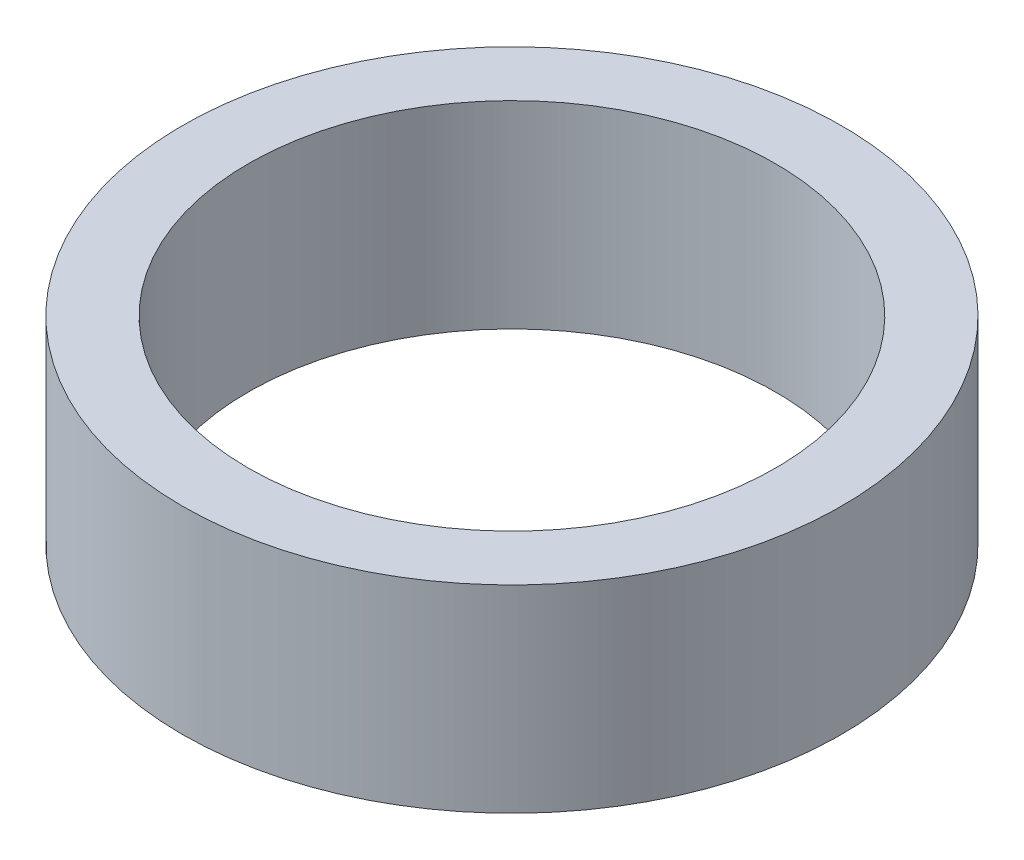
from build123d import *

# Parameters (mm, degrees)
SKETCH_1_R          = 5
EXTRUDE_1_DEPTH     = 3
SKETCH_2_R          = 4
CUT_EXTRUDE_1_DEPTH = 8.681145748


with BuildPart() as part:
    # Sketch 1 → Extrude 1 (new body)
    with BuildSketch(Plane(origin=(0, 0, 0), x_dir=(1, 0, 0), z_dir=(0, 1, 0))):
        with Locations(Location((0, 0, 0), (0, 0, 270))):
            Circle(SKETCH_1_R)
    extrude(amount=EXTRUDE_1_DEPTH)

    # Sketch 2 → Cut-Extrude 1 (cut, through all)
    with BuildSketch(Plane(origin=(0, 3, 0), x_dir=(1, 0, 0), z_dir=(0, 1, 0))):
        with Locations(Location((0, 0, 0), (0, 0, 270))):
            Circle(SKETCH_2_R)
    extrude(amount=-CUT_EXTRUDE_1_DEPTH, mode=Mode.SUBTRACT)


solid = part.part
